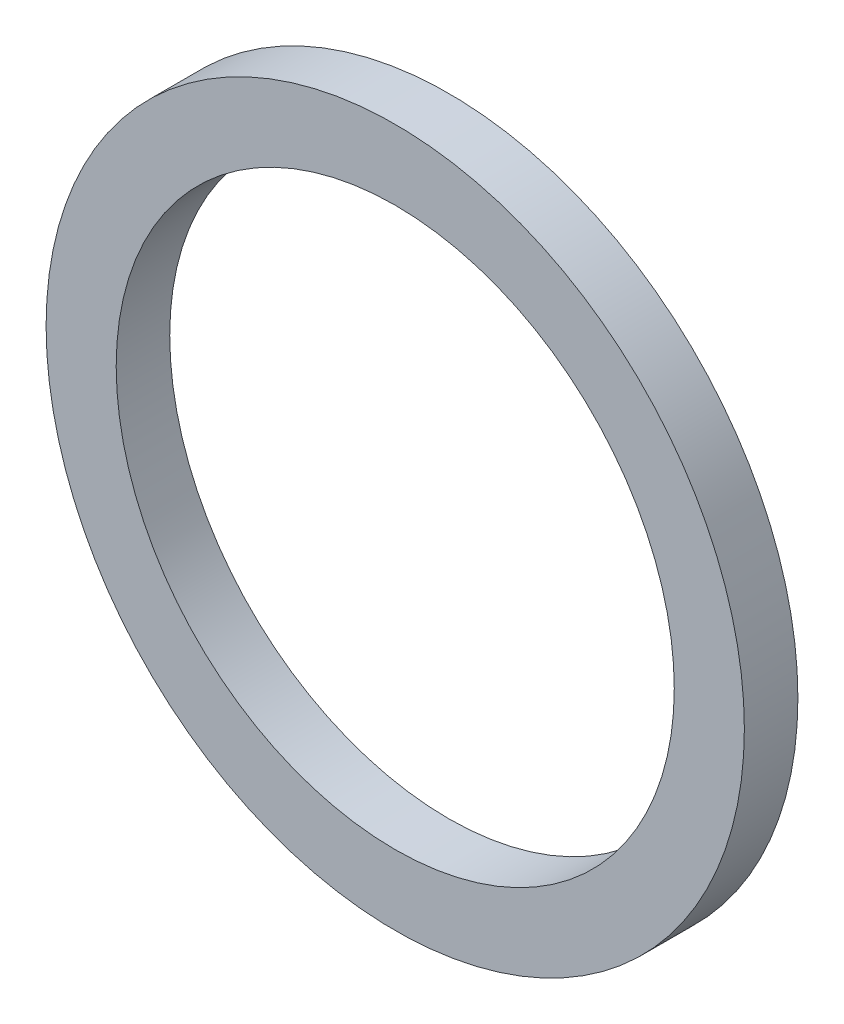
from build123d import *

# Parameters (mm, degrees)
SKETCH1_R           = 7.5
BOSS_EXTRUDE1_DEPTH = 1.15
SKETCH2_R           = 5.9944
CUT_EXTRUDE1_DEPTH  = 1.15


with BuildPart() as part:
    # Sketch1 → Boss-Extrude1 (new body)
    with BuildSketch(Plane.XY):
        Circle(SKETCH1_R)
    extrude(amount=BOSS_EXTRUDE1_DEPTH)

    # Sketch2 → Cut-Extrude1 (cut)
    with BuildSketch(Plane.XY.offset(1.15)):
        Circle(SKETCH2_R)
    extrude(amount=-CUT_EXTRUDE1_DEPTH, mode=Mode.SUBTRACT)


solid = part.part
